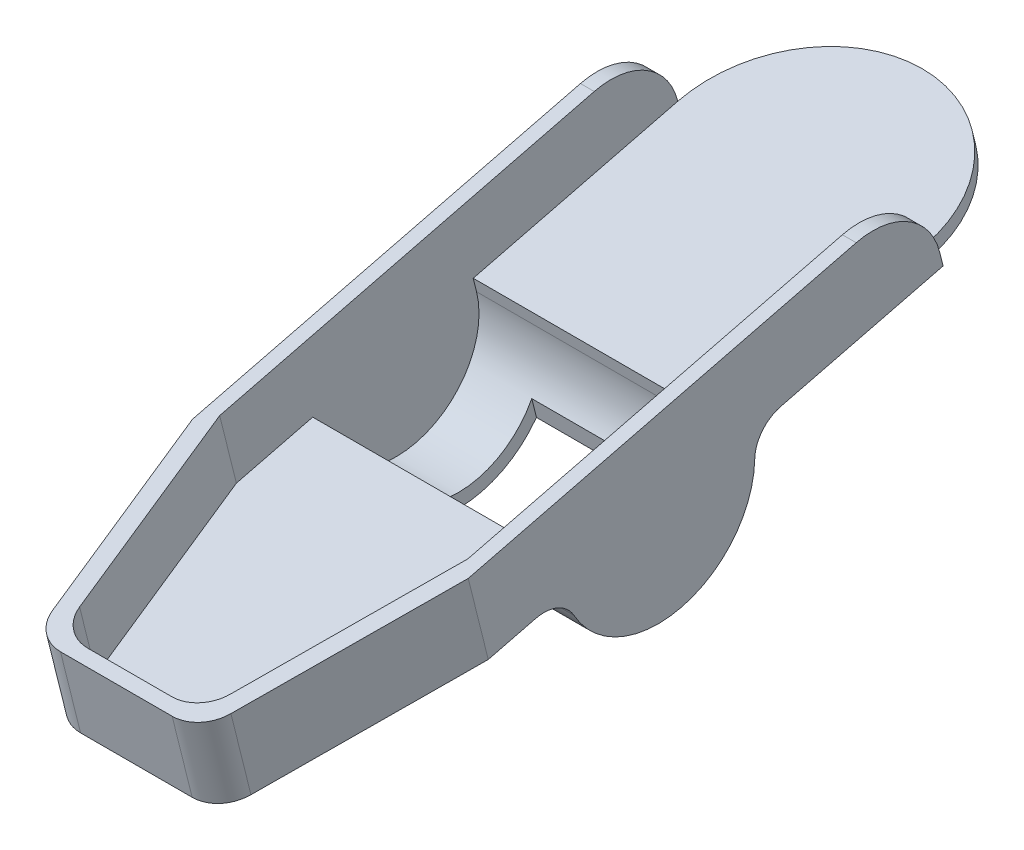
ISO-10303-21;
HEADER;
FILE_DESCRIPTION(('STEP AP214'),'2;1');
FILE_NAME('part.step','',(''),(''),'','','');
FILE_SCHEMA(('AUTOMOTIVE_DESIGN { 1 0 10303 214 1 1 1 1 }'));
ENDSEC;
DATA;
#1=APPLICATION_CONTEXT('core data for automotive mechanical design processes');
#2=APPLICATION_PROTOCOL_DEFINITION('international standard','automotive_design',2000,#1);
#3=PRODUCT_CONTEXT('',#1,'mechanical');
#4=PRODUCT('Part','Part','',(#3));
#5=PRODUCT_RELATED_PRODUCT_CATEGORY('part','',(#4));
#6=PRODUCT_DEFINITION_FORMATION('','',#4);
#7=PRODUCT_DEFINITION_CONTEXT('part definition',#1,'design');
#8=PRODUCT_DEFINITION('design','',#6,#7);
#9=PRODUCT_DEFINITION_SHAPE('','',#8);
#10=(LENGTH_UNIT() NAMED_UNIT(*) SI_UNIT(.MILLI.,.METRE.));
#11=(NAMED_UNIT(*) PLANE_ANGLE_UNIT() SI_UNIT($,.RADIAN.));
#12=(NAMED_UNIT(*) SI_UNIT($,.STERADIAN.) SOLID_ANGLE_UNIT());
#13=UNCERTAINTY_MEASURE_WITH_UNIT(LENGTH_MEASURE(1.E-05),#10,'distance_accuracy_value','');
#14=(GEOMETRIC_REPRESENTATION_CONTEXT(3) GLOBAL_UNCERTAINTY_ASSIGNED_CONTEXT((#13)) GLOBAL_UNIT_ASSIGNED_CONTEXT((#10,
#11,#12)) REPRESENTATION_CONTEXT('',''));
#15=CARTESIAN_POINT('',(0.,0.,0.));
#16=DIRECTION('',(0.,0.,1.));
#17=DIRECTION('',(1.,0.,0.));
#18=AXIS2_PLACEMENT_3D('',#15,#16,#17);
#19=CARTESIAN_POINT('',(-796.522223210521,-233.865141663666,-462.802278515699));
#20=DIRECTION('',(1.,0.,0.));
#21=DIRECTION('',(0.,0.,-1.));
#22=AXIS2_PLACEMENT_3D('',#19,#20,#21);
#23=CYLINDRICAL_SURFACE('',#22,3.17499999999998);
#24=CARTESIAN_POINT('',(-796.522223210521,-233.865141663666,-462.802278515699));
#25=DIRECTION('',(1.,0.,0.));
#26=DIRECTION('',(0.,0.,-1.));
#27=AXIS2_PLACEMENT_3D('',#24,#25,#26);
#28=CIRCLE('',#27,3.17499999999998);
#29=CARTESIAN_POINT('',(-796.522223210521,-232.313405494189,-465.572249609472));
#30=VERTEX_POINT('',#29);
#31=CARTESIAN_POINT('',(-796.522223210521,-230.784452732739,-462.03417649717));
#32=VERTEX_POINT('',#31);
#33=EDGE_CURVE('E310',#30,#32,#28,.T.);
#34=ORIENTED_EDGE('',*,*,#33,.F.);
#35=DIRECTION('',(1.,0.,0.));
#36=VECTOR('',#35,1.);
#37=CARTESIAN_POINT('',(-796.522223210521,-232.313405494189,-465.572249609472));
#38=LINE('',#37,#36);
#39=CARTESIAN_POINT('',(-771.122223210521,-232.313405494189,-465.572249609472));
#40=VERTEX_POINT('',#39);
#41=EDGE_CURVE('E382',#40,#30,#38,.F.);
#42=ORIENTED_EDGE('',*,*,#41,.F.);
#43=CARTESIAN_POINT('',(-771.122223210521,-233.865141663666,-462.802278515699));
#44=DIRECTION('',(1.,0.,0.));
#45=DIRECTION('',(0.,0.,-1.));
#46=AXIS2_PLACEMENT_3D('',#43,#44,#45);
#47=CIRCLE('',#46,3.17499999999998);
#48=CARTESIAN_POINT('',(-771.122223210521,-230.784452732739,-462.03417649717));
#49=VERTEX_POINT('',#48);
#50=EDGE_CURVE('E306',#49,#40,#47,.F.);
#51=ORIENTED_EDGE('',*,*,#50,.F.);
#52=DIRECTION('',(1.,0.,0.));
#53=VECTOR('',#52,1.);
#54=CARTESIAN_POINT('',(-783.822223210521,-230.784452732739,-462.03417649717));
#55=LINE('',#54,#53);
#56=EDGE_CURVE('E381',#32,#49,#55,.T.);
#57=ORIENTED_EDGE('',*,*,#56,.F.);
#58=EDGE_LOOP('',(#34,#42,#51,#57));
#59=FACE_BOUND('',#58,.T.);
#60=ADVANCED_FACE('F17',(#59),#23,.F.);
#61=CARTESIAN_POINT('',(-796.522223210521,-227.968544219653,-473.328168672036));
#62=DIRECTION('',(1.,0.,0.));
#63=DIRECTION('',(0.,0.,-1.));
#64=AXIS2_PLACEMENT_3D('',#61,#62,#63);
#65=CYLINDRICAL_SURFACE('',#64,8.89000000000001);
#66=DIRECTION('',(1.,0.,0.));
#67=VECTOR('',#66,1.);
#68=CARTESIAN_POINT('',(-783.822223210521,-233.193302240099,-480.520804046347));
#69=LINE('',#68,#67);
#70=CARTESIAN_POINT('',(-789.537223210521,-233.193302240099,-480.520804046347));
#71=VERTEX_POINT('',#70);
#72=CARTESIAN_POINT('',(-778.107223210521,-233.193302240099,-480.520804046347));
#73=VERTEX_POINT('',#72);
#74=EDGE_CURVE('E219',#71,#73,#69,.T.);
#75=ORIENTED_EDGE('',*,*,#74,.F.);
#76=CARTESIAN_POINT('',(-789.537223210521,-227.968544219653,-473.328168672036));
#77=DIRECTION('',(1.,0.,0.));
#78=DIRECTION('',(0.,0.,-1.));
#79=AXIS2_PLACEMENT_3D('',#76,#77,#78);
#80=CIRCLE('',#79,8.89000000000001);
#81=CARTESIAN_POINT('',(-789.537223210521,-235.958469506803,-469.430323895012));
#82=VERTEX_POINT('',#81);
#83=EDGE_CURVE('E20',#82,#71,#80,.T.);
#84=ORIENTED_EDGE('',*,*,#83,.F.);
#85=DIRECTION('',(1.,0.,0.));
#86=VECTOR('',#85,1.);
#87=CARTESIAN_POINT('',(-783.822223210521,-235.958469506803,-469.430323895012));
#88=LINE('',#87,#86);
#89=CARTESIAN_POINT('',(-778.107223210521,-235.958469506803,-469.430323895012));
#90=VERTEX_POINT('',#89);
#91=EDGE_CURVE('E216',#90,#82,#88,.F.);
#92=ORIENTED_EDGE('',*,*,#91,.F.);
#93=CARTESIAN_POINT('',(-778.107223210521,-227.968544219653,-473.328168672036));
#94=DIRECTION('',(1.,0.,0.));
#95=DIRECTION('',(0.,0.,-1.));
#96=AXIS2_PLACEMENT_3D('',#93,#94,#95);
#97=CIRCLE('',#96,8.89000000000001);
#98=EDGE_CURVE('E230',#73,#90,#97,.F.);
#99=ORIENTED_EDGE('',*,*,#98,.F.);
#100=EDGE_LOOP('',(#75,#84,#92,#99));
#101=FACE_BOUND('',#100,.T.);
#102=CARTESIAN_POINT('',(-796.522223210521,-227.968544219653,-473.328168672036));
#103=DIRECTION('',(1.,0.,0.));
#104=DIRECTION('',(0.,0.,-1.));
#105=AXIS2_PLACEMENT_3D('',#102,#103,#104);
#106=CIRCLE('',#105,8.89000000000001);
#107=CARTESIAN_POINT('',(-796.522223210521,-228.163645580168,-482.216027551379));
#108=VERTEX_POINT('',#107);
#109=EDGE_CURVE('E314',#108,#30,#106,.F.);
#110=ORIENTED_EDGE('',*,*,#109,.F.);
#111=DIRECTION('',(-1.,0.,0.));
#112=VECTOR('',#111,1.);
#113=CARTESIAN_POINT('',(-771.122223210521,-228.163645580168,-482.216027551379));
#114=LINE('',#113,#112);
#115=CARTESIAN_POINT('',(-771.122223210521,-228.163645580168,-482.216027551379));
#116=VERTEX_POINT('',#115);
#117=EDGE_CURVE('E347',#108,#116,#114,.F.);
#118=ORIENTED_EDGE('',*,*,#117,.T.);
#119=CARTESIAN_POINT('',(-771.122223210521,-227.968544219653,-473.328168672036));
#120=DIRECTION('',(1.,0.,0.));
#121=DIRECTION('',(0.,0.,-1.));
#122=AXIS2_PLACEMENT_3D('',#119,#120,#121);
#123=CIRCLE('',#122,8.89000000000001);
#124=EDGE_CURVE('E303',#40,#116,#123,.T.);
#125=ORIENTED_EDGE('',*,*,#124,.F.);
#126=ORIENTED_EDGE('',*,*,#41,.T.);
#127=EDGE_LOOP('',(#110,#118,#125,#126));
#128=FACE_BOUND('',#127,.T.);
#129=ADVANCED_FACE('F213',(#101,#128),#65,.T.);
#130=CARTESIAN_POINT('',(-783.822223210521,-221.426548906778,-499.566678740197));
#131=DIRECTION('',(0.,-0.970295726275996,-0.241921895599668));
#132=DIRECTION('',(0.,0.241921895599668,-0.970295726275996));
#133=AXIS2_PLACEMENT_3D('',#130,#131,#132);
#134=PLANE('',#133);
#135=ORIENTED_EDGE('',*,*,#56,.T.);
#136=DIRECTION('',(0.,0.241921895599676,-0.970295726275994));
#137=VECTOR('',#136,1.);
#138=CARTESIAN_POINT('',(-771.122223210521,-231.872736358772,-457.6693092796));
#139=LINE('',#138,#137);
#140=CARTESIAN_POINT('',(-771.122223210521,-231.872736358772,-457.6693092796));
#141=VERTEX_POINT('',#140);
#142=EDGE_CURVE('E309',#141,#49,#139,.T.);
#143=ORIENTED_EDGE('',*,*,#142,.F.);
#144=DIRECTION('',(0.242535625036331,0.234698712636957,-0.941325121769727));
#145=VECTOR('',#144,1.);
#146=CARTESIAN_POINT('',(-775.600985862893,-236.206779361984,-440.286412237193));
#147=LINE('',#146,#145);
#148=CARTESIAN_POINT('',(-775.600985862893,-236.206779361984,-440.286412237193));
#149=VERTEX_POINT('',#148);
#150=EDGE_CURVE('E374',#149,#141,#147,.T.);
#151=ORIENTED_EDGE('',*,*,#150,.F.);
#152=CARTESIAN_POINT('',(-778.681188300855,-236.020487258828,-441.033589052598));
#153=DIRECTION('',(0.,0.970295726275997,0.241921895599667));
#154=DIRECTION('',(0.,-0.241921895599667,0.970295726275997));
#155=AXIS2_PLACEMENT_3D('',#152,#153,#154);
#156=CIRCLE('',#155,3.17499999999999);
#157=CARTESIAN_POINT('',(-778.681188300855,-236.788589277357,-437.952900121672));
#158=VERTEX_POINT('',#157);
#159=EDGE_CURVE('E326',#158,#149,#156,.T.);
#160=ORIENTED_EDGE('',*,*,#159,.F.);
#161=DIRECTION('',(1.,0.,0.));
#162=VECTOR('',#161,1.);
#163=CARTESIAN_POINT('',(-776.202223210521,-236.788589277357,-437.952900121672));
#164=LINE('',#163,#162);
#165=CARTESIAN_POINT('',(-788.963258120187,-236.788589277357,-437.952900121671));
#166=VERTEX_POINT('',#165);
#167=EDGE_CURVE('E327',#166,#158,#164,.T.);
#168=ORIENTED_EDGE('',*,*,#167,.F.);
#169=CARTESIAN_POINT('',(-788.963258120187,-236.020487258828,-441.033589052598));
#170=DIRECTION('',(0.,0.970295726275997,0.241921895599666));
#171=DIRECTION('',(0.,-0.241921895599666,0.970295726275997));
#172=AXIS2_PLACEMENT_3D('',#169,#170,#171);
#173=CIRCLE('',#172,3.17500000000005);
#174=CARTESIAN_POINT('',(-792.043460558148,-236.206779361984,-440.286412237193));
#175=VERTEX_POINT('',#174);
#176=EDGE_CURVE('E321',#175,#166,#173,.T.);
#177=ORIENTED_EDGE('',*,*,#176,.F.);
#178=DIRECTION('',(0.242535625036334,-0.234698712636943,0.94132512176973));
#179=VECTOR('',#178,1.);
#180=CARTESIAN_POINT('',(-796.522223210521,-231.872736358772,-457.6693092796));
#181=LINE('',#180,#179);
#182=CARTESIAN_POINT('',(-796.522223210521,-231.872736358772,-457.6693092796));
#183=VERTEX_POINT('',#182);
#184=EDGE_CURVE('E385',#183,#175,#181,.T.);
#185=ORIENTED_EDGE('',*,*,#184,.F.);
#186=DIRECTION('',(0.,-0.241921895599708,0.970295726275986));
#187=VECTOR('',#186,1.);
#188=CARTESIAN_POINT('',(-796.522223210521,-230.784452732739,-462.03417649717));
#189=LINE('',#188,#187);
#190=EDGE_CURVE('E313',#32,#183,#189,.T.);
#191=ORIENTED_EDGE('',*,*,#190,.F.);
#192=EDGE_LOOP('',(#135,#143,#151,#160,#168,#177,#185,#191));
#193=FACE_BOUND('',#192,.T.);
#194=ADVANCED_FACE('F864',(#193),#134,.T.);
#195=CARTESIAN_POINT('',(-771.122223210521,-228.233324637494,-485.390262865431));
#196=DIRECTION('',(-1.,0.,0.));
#197=DIRECTION('',(0.,0.,1.));
#198=AXIS2_PLACEMENT_3D('',#195,#196,#197);
#199=CYLINDRICAL_SURFACE('',#198,3.17499999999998);
#200=CARTESIAN_POINT('',(-771.122223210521,-228.233324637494,-485.390262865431));
#201=DIRECTION('',(-1.,0.,0.));
#202=DIRECTION('',(0.,0.,1.));
#203=AXIS2_PLACEMENT_3D('',#200,#201,#202);
#204=CIRCLE('',#203,3.17499999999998);
#205=CARTESIAN_POINT('',(-771.122223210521,-225.152635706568,-484.622160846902));
#206=VERTEX_POINT('',#205);
#207=EDGE_CURVE('E300',#116,#206,#204,.T.);
#208=ORIENTED_EDGE('',*,*,#207,.F.);
#209=ORIENTED_EDGE('',*,*,#117,.F.);
#210=CARTESIAN_POINT('',(-796.522223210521,-228.233324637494,-485.390262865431));
#211=DIRECTION('',(-1.,0.,0.));
#212=DIRECTION('',(0.,0.,1.));
#213=AXIS2_PLACEMENT_3D('',#210,#211,#212);
#214=CIRCLE('',#213,3.17499999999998);
#215=CARTESIAN_POINT('',(-796.522223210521,-225.152635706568,-484.622160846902));
#216=VERTEX_POINT('',#215);
#217=EDGE_CURVE('E317',#216,#108,#214,.F.);
#218=ORIENTED_EDGE('',*,*,#217,.F.);
#219=DIRECTION('',(1.,0.,0.));
#220=VECTOR('',#219,1.);
#221=CARTESIAN_POINT('',(-783.822223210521,-225.152635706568,-484.622160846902));
#222=LINE('',#221,#220);
#223=EDGE_CURVE('E363',#206,#216,#222,.F.);
#224=ORIENTED_EDGE('',*,*,#223,.F.);
#225=EDGE_LOOP('',(#208,#209,#218,#224));
#226=FACE_BOUND('',#225,.T.);
#227=ADVANCED_FACE('F854',(#226),#199,.F.);
#228=CARTESIAN_POINT('',(-783.822223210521,-229.811989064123,-465.934515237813));
#229=DIRECTION('',(0.,0.241921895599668,-0.970295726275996));
#230=DIRECTION('',(0.,0.970295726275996,0.241921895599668));
#231=AXIS2_PLACEMENT_3D('',#228,#229,#230);
#232=PLANE('',#231);
#233=DIRECTION('',(1.,0.,0.));
#234=VECTOR('',#233,1.);
#235=CARTESIAN_POINT('',(-795.252223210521,-229.811989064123,-465.934515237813));
#236=LINE('',#235,#234);
#237=CARTESIAN_POINT('',(-772.392223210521,-229.811989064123,-465.934515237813));
#238=VERTEX_POINT('',#237);
#239=CARTESIAN_POINT('',(-795.252223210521,-229.811989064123,-465.934515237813));
#240=VERTEX_POINT('',#239);
#241=EDGE_CURVE('E286',#238,#240,#236,.F.);
#242=ORIENTED_EDGE('',*,*,#241,.T.);
#243=DIRECTION('',(0.,0.970295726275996,0.241921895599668));
#244=VECTOR('',#243,1.);
#245=CARTESIAN_POINT('',(-795.252223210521,-229.811989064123,-465.934515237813));
#246=LINE('',#245,#244);
#247=CARTESIAN_POINT('',(-795.252223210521,-228.579713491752,-465.627274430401));
#248=VERTEX_POINT('',#247);
#249=EDGE_CURVE('E222',#240,#248,#246,.T.);
#250=ORIENTED_EDGE('',*,*,#249,.T.);
#251=DIRECTION('',(1.,0.,0.));
#252=VECTOR('',#251,1.);
#253=CARTESIAN_POINT('',(-783.822223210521,-228.579713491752,-465.627274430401));
#254=LINE('',#253,#252);
#255=CARTESIAN_POINT('',(-772.392223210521,-228.579713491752,-465.627274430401));
#256=VERTEX_POINT('',#255);
#257=EDGE_CURVE('E290',#256,#248,#254,.F.);
#258=ORIENTED_EDGE('',*,*,#257,.F.);
#259=DIRECTION('',(0.,0.970295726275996,0.241921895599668));
#260=VECTOR('',#259,1.);
#261=CARTESIAN_POINT('',(-772.392223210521,-229.811989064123,-465.934515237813));
#262=LINE('',#261,#260);
#263=EDGE_CURVE('E344',#256,#238,#262,.F.);
#264=ORIENTED_EDGE('',*,*,#263,.T.);
#265=EDGE_LOOP('',(#242,#250,#258,#264));
#266=FACE_BOUND('',#265,.T.);
#267=ADVANCED_FACE('F845',(#266),#232,.T.);
#268=CARTESIAN_POINT('',(-789.537223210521,-234.129922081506,-474.864372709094));
#269=DIRECTION('',(1.,0.,0.));
#270=DIRECTION('',(0.,1.,0.));
#271=AXIS2_PLACEMENT_3D('',#268,#269,#270);
#272=PLANE('',#271);
#273=DIRECTION('',(0.,-0.970295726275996,-0.241921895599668));
#274=VECTOR('',#273,1.);
#275=CARTESIAN_POINT('',(-789.537223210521,-232.747338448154,-480.409612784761));
#276=LINE('',#275,#274);
#277=CARTESIAN_POINT('',(-789.537223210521,-231.47640265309,-480.092732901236));
#278=VERTEX_POINT('',#277);
#279=EDGE_CURVE('E331',#278,#71,#276,.T.);
#280=ORIENTED_EDGE('',*,*,#279,.F.);
#281=CARTESIAN_POINT('',(-789.537223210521,-227.968544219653,-473.328168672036));
#282=DIRECTION('',(1.,0.,0.));
#283=DIRECTION('',(0.,0.,-1.));
#284=AXIS2_PLACEMENT_3D('',#281,#282,#283);
#285=CIRCLE('',#284,7.62000000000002);
#286=CARTESIAN_POINT('',(-789.537223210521,-234.241569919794,-469.002252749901));
#287=VERTEX_POINT('',#286);
#288=EDGE_CURVE('E227',#278,#287,#285,.F.);
#289=ORIENTED_EDGE('',*,*,#288,.T.);
#290=DIRECTION('',(0.,0.970295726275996,0.241921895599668));
#291=VECTOR('',#290,1.);
#292=CARTESIAN_POINT('',(-789.537223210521,-235.512505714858,-469.319132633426));
#293=LINE('',#292,#291);
#294=EDGE_CURVE('E224',#82,#287,#293,.T.);
#295=ORIENTED_EDGE('',*,*,#294,.F.);
#296=ORIENTED_EDGE('',*,*,#83,.T.);
#297=EDGE_LOOP('',(#280,#289,#295,#296));
#298=FACE_BOUND('',#297,.T.);
#299=ADVANCED_FACE('F225',(#298),#272,.T.);
#300=CARTESIAN_POINT('',(-783.822223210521,-235.512505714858,-469.319132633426));
#301=DIRECTION('',(0.,0.241921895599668,-0.970295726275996));
#302=DIRECTION('',(0.,0.970295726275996,0.241921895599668));
#303=AXIS2_PLACEMENT_3D('',#300,#301,#302);
#304=PLANE('',#303);
#305=ORIENTED_EDGE('',*,*,#91,.T.);
#306=ORIENTED_EDGE('',*,*,#294,.T.);
#307=DIRECTION('',(1.,0.,0.));
#308=VECTOR('',#307,1.);
#309=CARTESIAN_POINT('',(-795.252223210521,-234.241569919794,-469.002252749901));
#310=LINE('',#309,#308);
#311=CARTESIAN_POINT('',(-778.107223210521,-234.241569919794,-469.002252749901));
#312=VERTEX_POINT('',#311);
#313=EDGE_CURVE('E284',#287,#312,#310,.T.);
#314=ORIENTED_EDGE('',*,*,#313,.T.);
#315=DIRECTION('',(0.,0.970295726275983,0.241921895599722));
#316=VECTOR('',#315,1.);
#317=CARTESIAN_POINT('',(-778.107223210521,-235.958469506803,-469.430323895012));
#318=LINE('',#317,#316);
#319=EDGE_CURVE('E234',#90,#312,#318,.T.);
#320=ORIENTED_EDGE('',*,*,#319,.F.);
#321=EDGE_LOOP('',(#305,#306,#314,#320));
#322=FACE_BOUND('',#321,.T.);
#323=ADVANCED_FACE('F232',(#322),#304,.T.);
#324=CARTESIAN_POINT('',(-778.107223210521,-234.129922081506,-474.864372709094));
#325=DIRECTION('',(-1.,0.,0.));
#326=DIRECTION('',(0.,-1.,0.));
#327=AXIS2_PLACEMENT_3D('',#324,#325,#326);
#328=PLANE('',#327);
#329=ORIENTED_EDGE('',*,*,#319,.T.);
#330=CARTESIAN_POINT('',(-778.107223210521,-227.968544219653,-473.328168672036));
#331=DIRECTION('',(1.,0.,0.));
#332=DIRECTION('',(0.,0.,-1.));
#333=AXIS2_PLACEMENT_3D('',#330,#331,#332);
#334=CIRCLE('',#333,7.62000000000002);
#335=CARTESIAN_POINT('',(-778.107223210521,-231.47640265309,-480.092732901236));
#336=VERTEX_POINT('',#335);
#337=EDGE_CURVE('E282',#312,#336,#334,.T.);
#338=ORIENTED_EDGE('',*,*,#337,.T.);
#339=DIRECTION('',(0.,-0.970295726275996,-0.241921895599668));
#340=VECTOR('',#339,1.);
#341=CARTESIAN_POINT('',(-778.107223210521,-232.747338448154,-480.409612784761));
#342=LINE('',#341,#340);
#343=EDGE_CURVE('E328',#73,#336,#342,.F.);
#344=ORIENTED_EDGE('',*,*,#343,.F.);
#345=ORIENTED_EDGE('',*,*,#98,.T.);
#346=EDGE_LOOP('',(#329,#338,#344,#345));
#347=FACE_BOUND('',#346,.T.);
#348=ADVANCED_FACE('F819',(#347),#328,.T.);
#349=CARTESIAN_POINT('',(-783.822223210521,-232.747338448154,-480.409612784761));
#350=DIRECTION('',(0.,-0.241921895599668,0.970295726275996));
#351=DIRECTION('',(0.,-0.970295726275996,-0.241921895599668));
#352=AXIS2_PLACEMENT_3D('',#349,#350,#351);
#353=PLANE('',#352);
#354=ORIENTED_EDGE('',*,*,#74,.T.);
#355=ORIENTED_EDGE('',*,*,#343,.T.);
#356=DIRECTION('',(1.,0.,0.));
#357=VECTOR('',#356,1.);
#358=CARTESIAN_POINT('',(-795.252223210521,-231.47640265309,-480.092732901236));
#359=LINE('',#358,#357);
#360=EDGE_CURVE('E281',#336,#278,#359,.F.);
#361=ORIENTED_EDGE('',*,*,#360,.T.);
#362=ORIENTED_EDGE('',*,*,#279,.T.);
#363=EDGE_LOOP('',(#354,#355,#361,#362));
#364=FACE_BOUND('',#363,.T.);
#365=ADVANCED_FACE('F809',(#364),#353,.T.);
#366=CARTESIAN_POINT('',(-778.681188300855,-236.020487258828,-441.033589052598));
#367=DIRECTION('',(0.,0.970295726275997,0.241921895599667));
#368=DIRECTION('',(0.,-0.241921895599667,0.970295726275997));
#369=AXIS2_PLACEMENT_3D('',#366,#367,#368);
#370=CYLINDRICAL_SURFACE('',#369,3.17499999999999);
#371=DIRECTION('',(0.,-0.970295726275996,-0.241921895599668));
#372=VECTOR('',#371,1.);
#373=CARTESIAN_POINT('',(-778.681188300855,-236.788589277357,-437.952900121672));
#374=LINE('',#373,#372);
#375=CARTESIAN_POINT('',(-778.681188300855,-229.394935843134,-436.109455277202));
#376=VERTEX_POINT('',#375);
#377=EDGE_CURVE('E325',#158,#376,#374,.F.);
#378=ORIENTED_EDGE('',*,*,#377,.F.);
#379=ORIENTED_EDGE('',*,*,#159,.T.);
#380=DIRECTION('',(0.,-0.970295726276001,-0.241921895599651));
#381=VECTOR('',#380,1.);
#382=CARTESIAN_POINT('',(-775.600985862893,-228.813125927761,-438.442967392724));
#383=LINE('',#382,#381);
#384=CARTESIAN_POINT('',(-775.600985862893,-228.813125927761,-438.442967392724));
#385=VERTEX_POINT('',#384);
#386=EDGE_CURVE('E377',#385,#149,#383,.T.);
#387=ORIENTED_EDGE('',*,*,#386,.F.);
#388=CARTESIAN_POINT('',(-778.681188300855,-228.626833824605,-439.190144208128));
#389=DIRECTION('',(0.,0.970295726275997,0.241921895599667));
#390=DIRECTION('',(0.,-0.241921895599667,0.970295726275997));
#391=AXIS2_PLACEMENT_3D('',#388,#389,#390);
#392=CIRCLE('',#391,3.17499999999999);
#393=EDGE_CURVE('E275',#385,#376,#392,.F.);
#394=ORIENTED_EDGE('',*,*,#393,.T.);
#395=EDGE_LOOP('',(#378,#379,#387,#394));
#396=FACE_BOUND('',#395,.T.);
#397=ADVANCED_FACE('F800',(#396),#370,.T.);
#398=CARTESIAN_POINT('',(-776.202223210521,-236.788589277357,-437.952900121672));
#399=DIRECTION('',(0.,-0.241921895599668,0.970295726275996));
#400=DIRECTION('',(0.,-0.970295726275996,-0.241921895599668));
#401=AXIS2_PLACEMENT_3D('',#398,#399,#400);
#402=PLANE('',#401);
#403=ORIENTED_EDGE('',*,*,#377,.T.);
#404=DIRECTION('',(1.,0.,0.));
#405=VECTOR('',#404,1.);
#406=CARTESIAN_POINT('',(-791.442223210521,-229.394935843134,-436.109455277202));
#407=LINE('',#406,#405);
#408=CARTESIAN_POINT('',(-788.963258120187,-229.394935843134,-436.109455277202));
#409=VERTEX_POINT('',#408);
#410=EDGE_CURVE('E274',#376,#409,#407,.F.);
#411=ORIENTED_EDGE('',*,*,#410,.T.);
#412=DIRECTION('',(0.,0.970295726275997,0.241921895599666));
#413=VECTOR('',#412,1.);
#414=CARTESIAN_POINT('',(-788.963258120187,-236.788589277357,-437.952900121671));
#415=LINE('',#414,#413);
#416=EDGE_CURVE('E324',#166,#409,#415,.T.);
#417=ORIENTED_EDGE('',*,*,#416,.F.);
#418=ORIENTED_EDGE('',*,*,#167,.T.);
#419=EDGE_LOOP('',(#403,#411,#417,#418));
#420=FACE_BOUND('',#419,.T.);
#421=ADVANCED_FACE('F791',(#420),#402,.T.);
#422=CARTESIAN_POINT('',(-788.963258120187,-236.020487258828,-441.033589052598));
#423=DIRECTION('',(0.,0.970295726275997,0.241921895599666));
#424=DIRECTION('',(0.,-0.241921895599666,0.970295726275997));
#425=AXIS2_PLACEMENT_3D('',#422,#423,#424);
#426=CYLINDRICAL_SURFACE('',#425,3.17500000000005);
#427=ORIENTED_EDGE('',*,*,#416,.T.);
#428=CARTESIAN_POINT('',(-788.963258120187,-228.626833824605,-439.190144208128));
#429=DIRECTION('',(0.,0.970295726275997,0.241921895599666));
#430=DIRECTION('',(0.,-0.241921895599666,0.970295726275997));
#431=AXIS2_PLACEMENT_3D('',#428,#429,#430);
#432=CIRCLE('',#431,3.17500000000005);
#433=CARTESIAN_POINT('',(-792.043460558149,-228.813125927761,-438.442967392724));
#434=VERTEX_POINT('',#433);
#435=EDGE_CURVE('E271',#409,#434,#432,.F.);
#436=ORIENTED_EDGE('',*,*,#435,.T.);
#437=DIRECTION('',(0.,0.970295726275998,0.241921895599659));
#438=VECTOR('',#437,1.);
#439=CARTESIAN_POINT('',(-792.043460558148,-236.206779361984,-440.286412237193));
#440=LINE('',#439,#438);
#441=EDGE_CURVE('E320',#175,#434,#440,.T.);
#442=ORIENTED_EDGE('',*,*,#441,.F.);
#443=ORIENTED_EDGE('',*,*,#176,.T.);
#444=EDGE_LOOP('',(#427,#436,#442,#443));
#445=FACE_BOUND('',#444,.T.);
#446=ADVANCED_FACE('F782',(#445),#426,.T.);
#447=CARTESIAN_POINT('',(-791.442223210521,-236.788589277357,-437.952900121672));
#448=DIRECTION('',(-0.970142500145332,-0.0586746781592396,0.235331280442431));
#449=DIRECTION('',(0.235737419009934,0.,0.971816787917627));
#450=AXIS2_PLACEMENT_3D('',#447,#448,#449);
#451=PLANE('',#450);
#452=ORIENTED_EDGE('',*,*,#441,.T.);
#453=DIRECTION('',(-0.242535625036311,0.234698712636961,-0.941325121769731));
#454=VECTOR('',#453,1.);
#455=CARTESIAN_POINT('',(-792.043460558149,-228.813125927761,-438.442967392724));
#456=LINE('',#455,#454);
#457=CARTESIAN_POINT('',(-796.522223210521,-224.479082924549,-455.82586443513));
#458=VERTEX_POINT('',#457);
#459=EDGE_CURVE('E273',#434,#458,#456,.T.);
#460=ORIENTED_EDGE('',*,*,#459,.T.);
#461=DIRECTION('',(0.,0.970295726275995,0.241921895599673));
#462=VECTOR('',#461,1.);
#463=CARTESIAN_POINT('',(-796.522223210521,-231.872736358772,-457.6693092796));
#464=LINE('',#463,#462);
#465=EDGE_CURVE('E441',#183,#458,#464,.T.);
#466=ORIENTED_EDGE('',*,*,#465,.F.);
#467=ORIENTED_EDGE('',*,*,#184,.T.);
#468=EDGE_LOOP('',(#452,#460,#466,#467));
#469=FACE_BOUND('',#468,.T.);
#470=ADVANCED_FACE('F460',(#469),#451,.T.);
#471=CARTESIAN_POINT('',(-796.522223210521,-231.872736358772,-457.6693092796));
#472=DIRECTION('',(-1.,0.,0.));
#473=DIRECTION('',(0.,0.,1.));
#474=AXIS2_PLACEMENT_3D('',#471,#472,#473);
#475=PLANE('',#474);
#476=ORIENTED_EDGE('',*,*,#190,.T.);
#477=ORIENTED_EDGE('',*,*,#465,.T.);
#478=DIRECTION('',(0.,0.241921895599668,-0.970295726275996));
#479=VECTOR('',#478,1.);
#480=CARTESIAN_POINT('',(-796.522223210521,-229.394935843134,-436.109455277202));
#481=LINE('',#480,#479);
#482=CARTESIAN_POINT('',(-796.522223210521,-215.569099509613,-491.561856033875));
#483=VERTEX_POINT('',#482);
#484=EDGE_CURVE('E444',#458,#483,#481,.T.);
#485=ORIENTED_EDGE('',*,*,#484,.T.);
#486=CARTESIAN_POINT('',(-796.522223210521,-221.730477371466,-493.098060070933));
#487=DIRECTION('',(1.,0.,0.));
#488=DIRECTION('',(0.,0.,-1.));
#489=AXIS2_PLACEMENT_3D('',#486,#487,#488);
#490=CIRCLE('',#489,6.34999999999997);
#491=CARTESIAN_POINT('',(-796.522223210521,-220.194273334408,-499.259437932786));
#492=VERTEX_POINT('',#491);
#493=EDGE_CURVE('E296',#492,#483,#490,.T.);
#494=ORIENTED_EDGE('',*,*,#493,.F.);
#495=DIRECTION('',(0.,0.970295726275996,0.241921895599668));
#496=VECTOR('',#495,1.);
#497=CARTESIAN_POINT('',(-796.522223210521,-221.426548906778,-499.566678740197));
#498=LINE('',#497,#496);
#499=CARTESIAN_POINT('',(-796.522223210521,-221.426548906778,-499.566678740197));
#500=VERTEX_POINT('',#499);
#501=EDGE_CURVE('E353',#500,#492,#498,.T.);
#502=ORIENTED_EDGE('',*,*,#501,.F.);
#503=DIRECTION('',(0.,0.241921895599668,-0.970295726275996));
#504=VECTOR('',#503,1.);
#505=CARTESIAN_POINT('',(-796.522223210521,-221.426548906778,-499.566678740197));
#506=LINE('',#505,#504);
#507=EDGE_CURVE('E359',#216,#500,#506,.T.);
#508=ORIENTED_EDGE('',*,*,#507,.F.);
#509=ORIENTED_EDGE('',*,*,#217,.T.);
#510=ORIENTED_EDGE('',*,*,#109,.T.);
#511=ORIENTED_EDGE('',*,*,#33,.T.);
#512=EDGE_LOOP('',(#476,#477,#485,#494,#502,#508,#509,#510,#511));
#513=FACE_BOUND('',#512,.T.);
#514=ADVANCED_FACE('F764',(#513),#475,.T.);
#515=CARTESIAN_POINT('',(-787.693258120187,-234.480970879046,-441.958623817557));
#516=DIRECTION('',(0.,0.970295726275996,0.241921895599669));
#517=DIRECTION('',(0.,-0.241921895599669,0.970295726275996));
#518=AXIS2_PLACEMENT_3D('',#515,#516,#517);
#519=CYLINDRICAL_SURFACE('',#518,3.17499999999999);
#520=CARTESIAN_POINT('',(-787.693258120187,-234.480970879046,-441.958623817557));
#521=DIRECTION('',(0.,0.970295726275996,0.241921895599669));
#522=DIRECTION('',(0.,-0.241921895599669,0.970295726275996));
#523=AXIS2_PLACEMENT_3D('',#520,#521,#522);
#524=CIRCLE('',#523,3.17499999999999);
#525=CARTESIAN_POINT('',(-790.773460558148,-234.667262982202,-441.211447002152));
#526=VERTEX_POINT('',#525);
#527=CARTESIAN_POINT('',(-787.693258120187,-235.249072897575,-438.87793488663));
#528=VERTEX_POINT('',#527);
#529=EDGE_CURVE('E292',#526,#528,#524,.T.);
#530=ORIENTED_EDGE('',*,*,#529,.F.);
#531=DIRECTION('',(0.,0.970295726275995,0.241921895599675));
#532=VECTOR('',#531,1.);
#533=CARTESIAN_POINT('',(-790.773460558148,-234.667262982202,-441.211447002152));
#534=LINE('',#533,#532);
#535=CARTESIAN_POINT('',(-790.773460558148,-228.505885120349,-439.675242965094));
#536=VERTEX_POINT('',#535);
#537=EDGE_CURVE('E442',#526,#536,#534,.T.);
#538=ORIENTED_EDGE('',*,*,#537,.T.);
#539=CARTESIAN_POINT('',(-787.693258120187,-228.319593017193,-440.422419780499));
#540=DIRECTION('',(0.,0.970295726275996,0.241921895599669));
#541=DIRECTION('',(0.,-0.241921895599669,0.970295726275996));
#542=AXIS2_PLACEMENT_3D('',#539,#540,#541);
#543=CIRCLE('',#542,3.17499999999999);
#544=CARTESIAN_POINT('',(-787.693258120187,-229.087695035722,-437.341730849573));
#545=VERTEX_POINT('',#544);
#546=EDGE_CURVE('E268',#536,#545,#543,.T.);
#547=ORIENTED_EDGE('',*,*,#546,.T.);
#548=DIRECTION('',(0.,-0.970295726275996,-0.241921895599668));
#549=VECTOR('',#548,1.);
#550=CARTESIAN_POINT('',(-787.693258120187,-235.249072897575,-438.87793488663));
#551=LINE('',#550,#549);
#552=EDGE_CURVE('E436',#545,#528,#551,.T.);
#553=ORIENTED_EDGE('',*,*,#552,.T.);
#554=EDGE_LOOP('',(#530,#538,#547,#553));
#555=FACE_BOUND('',#554,.T.);
#556=ADVANCED_FACE('F546',(#555),#519,.F.);
#557=CARTESIAN_POINT('',(-777.472223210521,-235.249072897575,-438.87793488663));
#558=DIRECTION('',(0.,-0.241921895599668,0.970295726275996));
#559=DIRECTION('',(0.,-0.970295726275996,-0.241921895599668));
#560=AXIS2_PLACEMENT_3D('',#557,#558,#559);
#561=PLANE('',#560);
#562=DIRECTION('',(0.,0.970295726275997,0.241921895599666));
#563=VECTOR('',#562,1.);
#564=CARTESIAN_POINT('',(-779.951188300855,-235.249072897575,-438.87793488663));
#565=LINE('',#564,#563);
#566=CARTESIAN_POINT('',(-779.951188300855,-229.087695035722,-437.341730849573));
#567=VERTEX_POINT('',#566);
#568=CARTESIAN_POINT('',(-779.951188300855,-235.249072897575,-438.87793488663));
#569=VERTEX_POINT('',#568);
#570=EDGE_CURVE('E356',#567,#569,#565,.F.);
#571=ORIENTED_EDGE('',*,*,#570,.T.);
#572=DIRECTION('',(1.,0.,0.));
#573=VECTOR('',#572,1.);
#574=CARTESIAN_POINT('',(-783.822223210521,-235.249072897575,-438.87793488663));
#575=LINE('',#574,#573);
#576=EDGE_CURVE('E291',#528,#569,#575,.T.);
#577=ORIENTED_EDGE('',*,*,#576,.F.);
#578=ORIENTED_EDGE('',*,*,#552,.F.);
#579=DIRECTION('',(1.,0.,0.));
#580=VECTOR('',#579,1.);
#581=CARTESIAN_POINT('',(-791.442223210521,-229.087695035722,-437.341730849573));
#582=LINE('',#581,#580);
#583=EDGE_CURVE('E267',#545,#567,#582,.T.);
#584=ORIENTED_EDGE('',*,*,#583,.T.);
#585=EDGE_LOOP('',(#571,#577,#578,#584));
#586=FACE_BOUND('',#585,.T.);
#587=ADVANCED_FACE('F549',(#586),#561,.F.);
#588=CARTESIAN_POINT('',(-771.122223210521,-221.426548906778,-499.566678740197));
#589=DIRECTION('',(1.,0.,0.));
#590=DIRECTION('',(0.,0.,-1.));
#591=AXIS2_PLACEMENT_3D('',#588,#589,#590);
#592=PLANE('',#591);
#593=ORIENTED_EDGE('',*,*,#207,.T.);
#594=DIRECTION('',(0.,0.241921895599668,-0.970295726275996));
#595=VECTOR('',#594,1.);
#596=CARTESIAN_POINT('',(-771.122223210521,-221.426548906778,-499.566678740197));
#597=LINE('',#596,#595);
#598=CARTESIAN_POINT('',(-771.122223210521,-221.426548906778,-499.566678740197));
#599=VERTEX_POINT('',#598);
#600=EDGE_CURVE('E368',#599,#206,#597,.F.);
#601=ORIENTED_EDGE('',*,*,#600,.F.);
#602=DIRECTION('',(0.,0.970295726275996,0.241921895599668));
#603=VECTOR('',#602,1.);
#604=CARTESIAN_POINT('',(-771.122223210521,-221.426548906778,-499.566678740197));
#605=LINE('',#604,#603);
#606=CARTESIAN_POINT('',(-771.122223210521,-220.194273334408,-499.259437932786));
#607=VERTEX_POINT('',#606);
#608=EDGE_CURVE('E355',#607,#599,#605,.F.);
#609=ORIENTED_EDGE('',*,*,#608,.F.);
#610=CARTESIAN_POINT('',(-771.122223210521,-221.730477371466,-493.098060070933));
#611=DIRECTION('',(1.,0.,0.));
#612=DIRECTION('',(0.,0.,-1.));
#613=AXIS2_PLACEMENT_3D('',#610,#611,#612);
#614=CIRCLE('',#613,6.34999999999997);
#615=CARTESIAN_POINT('',(-771.122223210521,-215.569099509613,-491.561856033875));
#616=VERTEX_POINT('',#615);
#617=EDGE_CURVE('E278',#616,#607,#614,.F.);
#618=ORIENTED_EDGE('',*,*,#617,.F.);
#619=DIRECTION('',(0.,0.241921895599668,-0.970295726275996));
#620=VECTOR('',#619,1.);
#621=CARTESIAN_POINT('',(-771.122223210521,-229.394935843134,-436.109455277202));
#622=LINE('',#621,#620);
#623=CARTESIAN_POINT('',(-771.122223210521,-224.479082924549,-455.82586443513));
#624=VERTEX_POINT('',#623);
#625=EDGE_CURVE('E430',#616,#624,#622,.F.);
#626=ORIENTED_EDGE('',*,*,#625,.T.);
#627=DIRECTION('',(0.,0.970295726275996,0.241921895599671));
#628=VECTOR('',#627,1.);
#629=CARTESIAN_POINT('',(-771.122223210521,-231.872736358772,-457.6693092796));
#630=LINE('',#629,#628);
#631=EDGE_CURVE('E302',#141,#624,#630,.T.);
#632=ORIENTED_EDGE('',*,*,#631,.F.);
#633=ORIENTED_EDGE('',*,*,#142,.T.);
#634=ORIENTED_EDGE('',*,*,#50,.T.);
#635=ORIENTED_EDGE('',*,*,#124,.T.);
#636=EDGE_LOOP('',(#593,#601,#609,#618,#626,#632,#633,#634,#635));
#637=FACE_BOUND('',#636,.T.);
#638=ADVANCED_FACE('F737',(#637),#592,.T.);
#639=CARTESIAN_POINT('',(-771.122223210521,-231.872736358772,-457.6693092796));
#640=DIRECTION('',(0.970142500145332,-0.05867467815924,0.235331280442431));
#641=DIRECTION('',(0.235737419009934,0.,-0.971816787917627));
#642=AXIS2_PLACEMENT_3D('',#639,#640,#641);
#643=PLANE('',#642);
#644=ORIENTED_EDGE('',*,*,#386,.T.);
#645=ORIENTED_EDGE('',*,*,#150,.T.);
#646=ORIENTED_EDGE('',*,*,#631,.T.);
#647=DIRECTION('',(-0.242535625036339,-0.234698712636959,0.941325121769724));
#648=VECTOR('',#647,1.);
#649=CARTESIAN_POINT('',(-771.122223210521,-224.479082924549,-455.82586443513));
#650=LINE('',#649,#648);
#651=EDGE_CURVE('E414',#624,#385,#650,.T.);
#652=ORIENTED_EDGE('',*,*,#651,.T.);
#653=EDGE_LOOP('',(#644,#645,#646,#652));
#654=FACE_BOUND('',#653,.T.);
#655=ADVANCED_FACE('F727',(#654),#643,.T.);
#656=CARTESIAN_POINT('',(-779.951188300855,-234.480970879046,-441.958623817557));
#657=DIRECTION('',(0.,0.970295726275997,0.241921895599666));
#658=DIRECTION('',(0.,-0.241921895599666,0.970295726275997));
#659=AXIS2_PLACEMENT_3D('',#656,#657,#658);
#660=CYLINDRICAL_SURFACE('',#659,3.17499999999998);
#661=CARTESIAN_POINT('',(-779.951188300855,-234.480970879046,-441.958623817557));
#662=DIRECTION('',(0.,0.970295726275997,0.241921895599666));
#663=DIRECTION('',(0.,-0.241921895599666,0.970295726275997));
#664=AXIS2_PLACEMENT_3D('',#661,#662,#663);
#665=CIRCLE('',#664,3.17499999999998);
#666=CARTESIAN_POINT('',(-776.870985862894,-234.667262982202,-441.211447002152));
#667=VERTEX_POINT('',#666);
#668=EDGE_CURVE('E287',#569,#667,#665,.T.);
#669=ORIENTED_EDGE('',*,*,#668,.F.);
#670=ORIENTED_EDGE('',*,*,#570,.F.);
#671=CARTESIAN_POINT('',(-779.951188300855,-228.319593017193,-440.422419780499));
#672=DIRECTION('',(0.,0.970295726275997,0.241921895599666));
#673=DIRECTION('',(0.,-0.241921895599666,0.970295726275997));
#674=AXIS2_PLACEMENT_3D('',#671,#672,#673);
#675=CIRCLE('',#674,3.17499999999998);
#676=CARTESIAN_POINT('',(-776.870985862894,-228.505885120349,-439.675242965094));
#677=VERTEX_POINT('',#676);
#678=EDGE_CURVE('E264',#567,#677,#675,.T.);
#679=ORIENTED_EDGE('',*,*,#678,.T.);
#680=DIRECTION('',(0.,-0.970295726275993,-0.24192189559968));
#681=VECTOR('',#680,1.);
#682=CARTESIAN_POINT('',(-776.870985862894,-228.505885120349,-439.675242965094));
#683=LINE('',#682,#681);
#684=EDGE_CURVE('E411',#677,#667,#683,.T.);
#685=ORIENTED_EDGE('',*,*,#684,.T.);
#686=EDGE_LOOP('',(#669,#670,#679,#685));
#687=FACE_BOUND('',#686,.T.);
#688=ADVANCED_FACE('F718',(#687),#660,.F.);
#689=CARTESIAN_POINT('',(-796.522223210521,-221.426548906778,-499.566678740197));
#690=DIRECTION('',(0.,0.241921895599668,-0.970295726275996));
#691=DIRECTION('',(0.,0.970295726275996,0.241921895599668));
#692=AXIS2_PLACEMENT_3D('',#689,#690,#691);
#693=PLANE('',#692);
#694=DIRECTION('',(1.,0.,0.));
#695=VECTOR('',#694,1.);
#696=CARTESIAN_POINT('',(-796.522223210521,-220.194273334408,-499.259437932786));
#697=LINE('',#696,#695);
#698=CARTESIAN_POINT('',(-795.252223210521,-220.194273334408,-499.259437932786));
#699=VERTEX_POINT('',#698);
#700=EDGE_CURVE('E299',#699,#492,#697,.F.);
#701=ORIENTED_EDGE('',*,*,#700,.F.);
#702=DIRECTION('',(0.,0.970295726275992,0.241921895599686));
#703=VECTOR('',#702,1.);
#704=CARTESIAN_POINT('',(-795.252223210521,-221.426548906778,-499.566678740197));
#705=LINE('',#704,#703);
#706=CARTESIAN_POINT('',(-795.252223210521,-221.426548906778,-499.566678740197));
#707=VERTEX_POINT('',#706);
#708=EDGE_CURVE('E481',#707,#699,#705,.T.);
#709=ORIENTED_EDGE('',*,*,#708,.F.);
#710=DIRECTION('',(1.,0.,0.));
#711=VECTOR('',#710,1.);
#712=CARTESIAN_POINT('',(-783.822223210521,-221.426548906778,-499.566678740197));
#713=LINE('',#712,#711);
#714=EDGE_CURVE('E362',#500,#707,#713,.T.);
#715=ORIENTED_EDGE('',*,*,#714,.F.);
#716=ORIENTED_EDGE('',*,*,#501,.T.);
#717=EDGE_LOOP('',(#701,#709,#715,#716));
#718=FACE_BOUND('',#717,.T.);
#719=ADVANCED_FACE('F709',(#718),#693,.T.);
#720=CARTESIAN_POINT('',(-796.522223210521,-221.426548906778,-499.566678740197));
#721=DIRECTION('',(0.,0.241921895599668,-0.970295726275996));
#722=DIRECTION('',(0.,0.970295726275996,0.241921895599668));
#723=AXIS2_PLACEMENT_3D('',#720,#721,#722);
#724=PLANE('',#723);
#725=DIRECTION('',(1.,0.,0.));
#726=VECTOR('',#725,1.);
#727=CARTESIAN_POINT('',(-772.392223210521,-220.194273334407,-499.259437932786));
#728=LINE('',#727,#726);
#729=CARTESIAN_POINT('',(-772.392223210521,-220.194273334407,-499.259437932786));
#730=VERTEX_POINT('',#729);
#731=EDGE_CURVE('E277',#607,#730,#728,.F.);
#732=ORIENTED_EDGE('',*,*,#731,.F.);
#733=ORIENTED_EDGE('',*,*,#608,.T.);
#734=DIRECTION('',(1.,0.,0.));
#735=VECTOR('',#734,1.);
#736=CARTESIAN_POINT('',(-783.822223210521,-221.426548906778,-499.566678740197));
#737=LINE('',#736,#735);
#738=CARTESIAN_POINT('',(-772.392223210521,-221.426548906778,-499.566678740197));
#739=VERTEX_POINT('',#738);
#740=EDGE_CURVE('E371',#739,#599,#737,.T.);
#741=ORIENTED_EDGE('',*,*,#740,.F.);
#742=DIRECTION('',(0.,0.970295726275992,0.241921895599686));
#743=VECTOR('',#742,1.);
#744=CARTESIAN_POINT('',(-772.392223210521,-221.426548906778,-499.566678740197));
#745=LINE('',#744,#743);
#746=EDGE_CURVE('E263',#730,#739,#745,.F.);
#747=ORIENTED_EDGE('',*,*,#746,.F.);
#748=EDGE_LOOP('',(#732,#733,#741,#747));
#749=FACE_BOUND('',#748,.T.);
#750=ADVANCED_FACE('F700',(#749),#724,.T.);
#751=CARTESIAN_POINT('',(-783.822223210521,-221.426548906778,-499.566678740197));
#752=DIRECTION('',(0.,-0.970295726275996,-0.241921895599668));
#753=DIRECTION('',(0.,0.241921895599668,-0.970295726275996));
#754=AXIS2_PLACEMENT_3D('',#751,#752,#753);
#755=PLANE('',#754);
#756=ORIENTED_EDGE('',*,*,#714,.T.);
#757=CARTESIAN_POINT('',(-783.822223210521,-221.426548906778,-499.566678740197));
#758=DIRECTION('',(0.,0.970295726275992,0.241921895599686));
#759=DIRECTION('',(0.,-0.241921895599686,0.970295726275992));
#760=AXIS2_PLACEMENT_3D('',#757,#758,#759);
#761=CIRCLE('',#760,11.43);
#762=EDGE_CURVE('E260',#739,#707,#761,.T.);
#763=ORIENTED_EDGE('',*,*,#762,.F.);
#764=ORIENTED_EDGE('',*,*,#740,.T.);
#765=ORIENTED_EDGE('',*,*,#600,.T.);
#766=ORIENTED_EDGE('',*,*,#223,.T.);
#767=ORIENTED_EDGE('',*,*,#507,.T.);
#768=EDGE_LOOP('',(#756,#763,#764,#765,#766,#767));
#769=FACE_BOUND('',#768,.T.);
#770=ADVANCED_FACE('F515',(#769),#755,.T.);
#771=CARTESIAN_POINT('',(-790.172223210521,-235.249072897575,-438.87793488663));
#772=DIRECTION('',(-0.970142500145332,-0.0586746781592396,0.23533128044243));
#773=DIRECTION('',(0.235737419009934,0.,0.971816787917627));
#774=AXIS2_PLACEMENT_3D('',#771,#772,#773);
#775=PLANE('',#774);
#776=DIRECTION('',(0.,0.970295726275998,0.241921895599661));
#777=VECTOR('',#776,1.);
#778=CARTESIAN_POINT('',(-795.252223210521,-230.33321997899,-458.594344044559));
#779=LINE('',#778,#777);
#780=CARTESIAN_POINT('',(-795.252223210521,-230.33321997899,-458.594344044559));
#781=VERTEX_POINT('',#780);
#782=CARTESIAN_POINT('',(-795.252223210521,-224.171842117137,-457.058140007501));
#783=VERTEX_POINT('',#782);
#784=EDGE_CURVE('E502',#781,#783,#779,.T.);
#785=ORIENTED_EDGE('',*,*,#784,.T.);
#786=DIRECTION('',(0.242535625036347,-0.23469871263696,0.941325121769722));
#787=VECTOR('',#786,1.);
#788=CARTESIAN_POINT('',(-795.252223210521,-224.171842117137,-457.058140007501));
#789=LINE('',#788,#787);
#790=EDGE_CURVE('E270',#783,#536,#789,.T.);
#791=ORIENTED_EDGE('',*,*,#790,.T.);
#792=ORIENTED_EDGE('',*,*,#537,.F.);
#793=DIRECTION('',(0.242535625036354,-0.234698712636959,0.94132512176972));
#794=VECTOR('',#793,1.);
#795=CARTESIAN_POINT('',(-795.252223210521,-230.333219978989,-458.594344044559));
#796=LINE('',#795,#794);
#797=EDGE_CURVE('E295',#781,#526,#796,.T.);
#798=ORIENTED_EDGE('',*,*,#797,.F.);
#799=EDGE_LOOP('',(#785,#791,#792,#798));
#800=FACE_BOUND('',#799,.T.);
#801=ADVANCED_FACE('F537',(#800),#775,.F.);
#802=CARTESIAN_POINT('',(-796.522223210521,-221.730477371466,-493.098060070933));
#803=DIRECTION('',(1.,0.,0.));
#804=DIRECTION('',(0.,0.,-1.));
#805=AXIS2_PLACEMENT_3D('',#802,#803,#804);
#806=CYLINDRICAL_SURFACE('',#805,6.34999999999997);
#807=DIRECTION('',(1.,0.,0.));
#808=VECTOR('',#807,1.);
#809=CARTESIAN_POINT('',(-791.442223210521,-215.569099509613,-491.561856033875));
#810=LINE('',#809,#808);
#811=CARTESIAN_POINT('',(-795.252223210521,-215.569099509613,-491.561856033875));
#812=VERTEX_POINT('',#811);
#813=EDGE_CURVE('E446',#483,#812,#810,.T.);
#814=ORIENTED_EDGE('',*,*,#813,.T.);
#815=CARTESIAN_POINT('',(-795.252223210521,-221.730477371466,-493.098060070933));
#816=DIRECTION('',(1.,0.,0.));
#817=DIRECTION('',(0.,0.,-1.));
#818=AXIS2_PLACEMENT_3D('',#815,#816,#817);
#819=CIRCLE('',#818,6.34999999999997);
#820=EDGE_CURVE('E251',#812,#699,#819,.F.);
#821=ORIENTED_EDGE('',*,*,#820,.T.);
#822=ORIENTED_EDGE('',*,*,#700,.T.);
#823=ORIENTED_EDGE('',*,*,#493,.T.);
#824=EDGE_LOOP('',(#814,#821,#822,#823));
#825=FACE_BOUND('',#824,.T.);
#826=ADVANCED_FACE('F674',(#825),#806,.T.);
#827=CARTESIAN_POINT('',(-783.822223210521,-220.194273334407,-499.259437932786));
#828=DIRECTION('',(0.,0.970295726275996,0.241921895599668));
#829=DIRECTION('',(0.,-0.241921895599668,0.970295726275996));
#830=AXIS2_PLACEMENT_3D('',#827,#828,#829);
#831=PLANE('',#830);
#832=DIRECTION('',(0.,0.241921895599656,-0.970295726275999));
#833=VECTOR('',#832,1.);
#834=CARTESIAN_POINT('',(-772.392223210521,-230.33321997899,-458.594344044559));
#835=LINE('',#834,#833);
#836=CARTESIAN_POINT('',(-772.392223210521,-230.33321997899,-458.594344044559));
#837=VERTEX_POINT('',#836);
#838=EDGE_CURVE('E250',#837,#256,#835,.T.);
#839=ORIENTED_EDGE('',*,*,#838,.T.);
#840=ORIENTED_EDGE('',*,*,#257,.T.);
#841=DIRECTION('',(0.,-0.24192189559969,0.970295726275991));
#842=VECTOR('',#841,1.);
#843=CARTESIAN_POINT('',(-795.252223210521,-228.579713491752,-465.627274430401));
#844=LINE('',#843,#842);
#845=EDGE_CURVE('E259',#248,#781,#844,.T.);
#846=ORIENTED_EDGE('',*,*,#845,.T.);
#847=ORIENTED_EDGE('',*,*,#797,.T.);
#848=ORIENTED_EDGE('',*,*,#529,.T.);
#849=ORIENTED_EDGE('',*,*,#576,.T.);
#850=ORIENTED_EDGE('',*,*,#668,.T.);
#851=DIRECTION('',(0.242535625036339,0.234698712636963,-0.941325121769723));
#852=VECTOR('',#851,1.);
#853=CARTESIAN_POINT('',(-776.870985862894,-234.667262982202,-441.211447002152));
#854=LINE('',#853,#852);
#855=EDGE_CURVE('E413',#667,#837,#854,.T.);
#856=ORIENTED_EDGE('',*,*,#855,.T.);
#857=EDGE_LOOP('',(#839,#840,#846,#847,#848,#849,#850,#856));
#858=FACE_BOUND('',#857,.T.);
#859=ADVANCED_FACE('F553',(#858),#831,.T.);
#860=CARTESIAN_POINT('',(-795.252223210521,-227.968544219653,-473.328168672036));
#861=DIRECTION('',(1.,0.,0.));
#862=DIRECTION('',(0.,0.,-1.));
#863=AXIS2_PLACEMENT_3D('',#860,#861,#862);
#864=CYLINDRICAL_SURFACE('',#863,7.62000000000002);
#865=DIRECTION('',(1.,0.,0.));
#866=VECTOR('',#865,1.);
#867=CARTESIAN_POINT('',(-783.822223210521,-226.125099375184,-480.721822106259));
#868=LINE('',#867,#866);
#869=CARTESIAN_POINT('',(-795.252223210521,-226.125099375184,-480.721822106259));
#870=VERTEX_POINT('',#869);
#871=CARTESIAN_POINT('',(-772.392223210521,-226.125099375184,-480.721822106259));
#872=VERTEX_POINT('',#871);
#873=EDGE_CURVE('E421',#870,#872,#868,.T.);
#874=ORIENTED_EDGE('',*,*,#873,.F.);
#875=CARTESIAN_POINT('',(-795.252223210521,-227.968544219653,-473.328168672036));
#876=DIRECTION('',(1.,0.,0.));
#877=DIRECTION('',(0.,0.,-1.));
#878=AXIS2_PLACEMENT_3D('',#875,#876,#877);
#879=CIRCLE('',#878,7.62000000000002);
#880=EDGE_CURVE('E256',#870,#240,#879,.F.);
#881=ORIENTED_EDGE('',*,*,#880,.T.);
#882=ORIENTED_EDGE('',*,*,#241,.F.);
#883=CARTESIAN_POINT('',(-772.392223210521,-227.968544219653,-473.328168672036));
#884=DIRECTION('',(1.,0.,0.));
#885=DIRECTION('',(0.,0.,-1.));
#886=AXIS2_PLACEMENT_3D('',#883,#884,#885);
#887=CIRCLE('',#886,7.62000000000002);
#888=EDGE_CURVE('E248',#238,#872,#887,.T.);
#889=ORIENTED_EDGE('',*,*,#888,.T.);
#890=EDGE_LOOP('',(#874,#881,#882,#889));
#891=FACE_BOUND('',#890,.T.);
#892=ORIENTED_EDGE('',*,*,#337,.F.);
#893=ORIENTED_EDGE('',*,*,#313,.F.);
#894=ORIENTED_EDGE('',*,*,#288,.F.);
#895=ORIENTED_EDGE('',*,*,#360,.F.);
#896=EDGE_LOOP('',(#892,#893,#894,#895));
#897=FACE_BOUND('',#896,.T.);
#898=ADVANCED_FACE('F655',(#891,#897),#864,.F.);
#899=CARTESIAN_POINT('',(-772.392223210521,-221.730477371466,-493.098060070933));
#900=DIRECTION('',(1.,0.,0.));
#901=DIRECTION('',(0.,0.,-1.));
#902=AXIS2_PLACEMENT_3D('',#899,#900,#901);
#903=CYLINDRICAL_SURFACE('',#902,6.34999999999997);
#904=ORIENTED_EDGE('',*,*,#731,.T.);
#905=CARTESIAN_POINT('',(-772.392223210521,-221.730477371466,-493.098060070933));
#906=DIRECTION('',(1.,0.,0.));
#907=DIRECTION('',(0.,0.,-1.));
#908=AXIS2_PLACEMENT_3D('',#905,#906,#907);
#909=CIRCLE('',#908,6.34999999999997);
#910=CARTESIAN_POINT('',(-772.392223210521,-215.569099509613,-491.561856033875));
#911=VERTEX_POINT('',#910);
#912=EDGE_CURVE('E245',#730,#911,#909,.T.);
#913=ORIENTED_EDGE('',*,*,#912,.T.);
#914=DIRECTION('',(1.,0.,0.));
#915=VECTOR('',#914,1.);
#916=CARTESIAN_POINT('',(-791.442223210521,-215.569099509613,-491.561856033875));
#917=LINE('',#916,#915);
#918=EDGE_CURVE('E266',#911,#616,#917,.T.);
#919=ORIENTED_EDGE('',*,*,#918,.T.);
#920=ORIENTED_EDGE('',*,*,#617,.T.);
#921=EDGE_LOOP('',(#904,#913,#919,#920));
#922=FACE_BOUND('',#921,.T.);
#923=ADVANCED_FACE('F646',(#922),#903,.T.);
#924=CARTESIAN_POINT('',(-791.442223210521,-229.394935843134,-436.109455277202));
#925=DIRECTION('',(0.,-0.970295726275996,-0.241921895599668));
#926=DIRECTION('',(0.,0.241921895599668,-0.970295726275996));
#927=AXIS2_PLACEMENT_3D('',#924,#925,#926);
#928=PLANE('',#927);
#929=ORIENTED_EDGE('',*,*,#625,.F.);
#930=ORIENTED_EDGE('',*,*,#918,.F.);
#931=DIRECTION('',(0.,-0.24192189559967,0.970295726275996));
#932=VECTOR('',#931,1.);
#933=CARTESIAN_POINT('',(-772.392223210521,-215.569099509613,-491.561856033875));
#934=LINE('',#933,#932);
#935=CARTESIAN_POINT('',(-772.392223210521,-224.171842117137,-457.058140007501));
#936=VERTEX_POINT('',#935);
#937=EDGE_CURVE('E247',#911,#936,#934,.T.);
#938=ORIENTED_EDGE('',*,*,#937,.T.);
#939=DIRECTION('',(-0.242535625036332,-0.234698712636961,0.941325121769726));
#940=VECTOR('',#939,1.);
#941=CARTESIAN_POINT('',(-772.392223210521,-224.171842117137,-457.058140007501));
#942=LINE('',#941,#940);
#943=EDGE_CURVE('E416',#936,#677,#942,.T.);
#944=ORIENTED_EDGE('',*,*,#943,.T.);
#945=ORIENTED_EDGE('',*,*,#678,.F.);
#946=ORIENTED_EDGE('',*,*,#583,.F.);
#947=ORIENTED_EDGE('',*,*,#546,.F.);
#948=ORIENTED_EDGE('',*,*,#790,.F.);
#949=DIRECTION('',(0.,0.241921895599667,-0.970295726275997));
#950=VECTOR('',#949,1.);
#951=CARTESIAN_POINT('',(-795.252223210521,-224.171842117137,-457.058140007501));
#952=LINE('',#951,#950);
#953=EDGE_CURVE('E255',#783,#812,#952,.T.);
#954=ORIENTED_EDGE('',*,*,#953,.T.);
#955=ORIENTED_EDGE('',*,*,#813,.F.);
#956=ORIENTED_EDGE('',*,*,#484,.F.);
#957=ORIENTED_EDGE('',*,*,#459,.F.);
#958=ORIENTED_EDGE('',*,*,#435,.F.);
#959=ORIENTED_EDGE('',*,*,#410,.F.);
#960=ORIENTED_EDGE('',*,*,#393,.F.);
#961=ORIENTED_EDGE('',*,*,#651,.F.);
#962=EDGE_LOOP('',(#929,#930,#938,#944,#945,#946,#947,#948,#954,#955,#956,#957,#958,#959,#960,#961));
#963=FACE_BOUND('',#962,.T.);
#964=ADVANCED_FACE('F467',(#963),#928,.F.);
#965=CARTESIAN_POINT('',(-772.392223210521,-230.33321997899,-458.594344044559));
#966=DIRECTION('',(0.970142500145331,-0.058674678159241,0.235331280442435));
#967=DIRECTION('',(0.235737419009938,0.,-0.971816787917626));
#968=AXIS2_PLACEMENT_3D('',#965,#966,#967);
#969=PLANE('',#968);
#970=DIRECTION('',(0.,-0.970295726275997,-0.241921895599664));
#971=VECTOR('',#970,1.);
#972=CARTESIAN_POINT('',(-772.392223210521,-224.171842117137,-457.058140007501));
#973=LINE('',#972,#971);
#974=EDGE_CURVE('E244',#936,#837,#973,.T.);
#975=ORIENTED_EDGE('',*,*,#974,.T.);
#976=ORIENTED_EDGE('',*,*,#855,.F.);
#977=ORIENTED_EDGE('',*,*,#684,.F.);
#978=ORIENTED_EDGE('',*,*,#943,.F.);
#979=EDGE_LOOP('',(#975,#976,#977,#978));
#980=FACE_BOUND('',#979,.T.);
#981=ADVANCED_FACE('F628',(#980),#969,.F.);
#982=CARTESIAN_POINT('',(-783.822223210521,-221.426548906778,-499.566678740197));
#983=DIRECTION('',(0.,0.970295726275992,0.241921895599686));
#984=DIRECTION('',(0.,-0.241921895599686,0.970295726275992));
#985=AXIS2_PLACEMENT_3D('',#982,#983,#984);
#986=CYLINDRICAL_SURFACE('',#985,11.43);
#987=ORIENTED_EDGE('',*,*,#746,.T.);
#988=ORIENTED_EDGE('',*,*,#762,.T.);
#989=ORIENTED_EDGE('',*,*,#708,.T.);
#990=CARTESIAN_POINT('',(-783.822223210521,-220.194273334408,-499.259437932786));
#991=DIRECTION('',(0.,0.970295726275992,0.241921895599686));
#992=DIRECTION('',(0.,-0.241921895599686,0.970295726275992));
#993=AXIS2_PLACEMENT_3D('',#990,#991,#992);
#994=CIRCLE('',#993,11.43);
#995=EDGE_CURVE('E240',#730,#699,#994,.T.);
#996=ORIENTED_EDGE('',*,*,#995,.F.);
#997=EDGE_LOOP('',(#987,#988,#989,#996));
#998=FACE_BOUND('',#997,.T.);
#999=ADVANCED_FACE('F521',(#998),#986,.T.);
#1000=CARTESIAN_POINT('',(-795.252223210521,-230.33321997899,-458.594344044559));
#1001=DIRECTION('',(-1.,0.,0.));
#1002=DIRECTION('',(0.,-1.,0.));
#1003=AXIS2_PLACEMENT_3D('',#1000,#1001,#1002);
#1004=PLANE('',#1003);
#1005=ORIENTED_EDGE('',*,*,#953,.F.);
#1006=ORIENTED_EDGE('',*,*,#784,.F.);
#1007=ORIENTED_EDGE('',*,*,#845,.F.);
#1008=ORIENTED_EDGE('',*,*,#249,.F.);
#1009=ORIENTED_EDGE('',*,*,#880,.F.);
#1010=DIRECTION('',(0.,-0.970295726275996,-0.241921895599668));
#1011=VECTOR('',#1010,1.);
#1012=CARTESIAN_POINT('',(-795.252223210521,-226.125099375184,-480.721822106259));
#1013=LINE('',#1012,#1011);
#1014=CARTESIAN_POINT('',(-795.252223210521,-224.892823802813,-480.414581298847));
#1015=VERTEX_POINT('',#1014);
#1016=EDGE_CURVE('E254',#1015,#870,#1013,.T.);
#1017=ORIENTED_EDGE('',*,*,#1016,.F.);
#1018=DIRECTION('',(0.,-0.241921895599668,0.970295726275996));
#1019=VECTOR('',#1018,1.);
#1020=CARTESIAN_POINT('',(-795.252223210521,-220.194273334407,-499.259437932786));
#1021=LINE('',#1020,#1019);
#1022=EDGE_CURVE('E243',#699,#1015,#1021,.T.);
#1023=ORIENTED_EDGE('',*,*,#1022,.F.);
#1024=ORIENTED_EDGE('',*,*,#820,.F.);
#1025=EDGE_LOOP('',(#1005,#1006,#1007,#1008,#1009,#1017,#1023,#1024));
#1026=FACE_BOUND('',#1025,.T.);
#1027=ADVANCED_FACE('F557',(#1026),#1004,.F.);
#1028=CARTESIAN_POINT('',(-783.822223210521,-226.125099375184,-480.721822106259));
#1029=DIRECTION('',(0.,-0.241921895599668,0.970295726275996));
#1030=DIRECTION('',(0.,-0.970295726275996,-0.241921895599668));
#1031=AXIS2_PLACEMENT_3D('',#1028,#1029,#1030);
#1032=PLANE('',#1031);
#1033=ORIENTED_EDGE('',*,*,#873,.T.);
#1034=DIRECTION('',(0.,0.97029572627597,0.241921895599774));
#1035=VECTOR('',#1034,1.);
#1036=CARTESIAN_POINT('',(-772.392223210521,-226.125099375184,-480.721822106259));
#1037=LINE('',#1036,#1035);
#1038=CARTESIAN_POINT('',(-772.392223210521,-224.892823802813,-480.414581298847));
#1039=VERTEX_POINT('',#1038);
#1040=EDGE_CURVE('E35',#872,#1039,#1037,.T.);
#1041=ORIENTED_EDGE('',*,*,#1040,.T.);
#1042=DIRECTION('',(1.,0.,0.));
#1043=VECTOR('',#1042,1.);
#1044=CARTESIAN_POINT('',(-783.822223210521,-224.892823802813,-480.414581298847));
#1045=LINE('',#1044,#1043);
#1046=EDGE_CURVE('E26',#1015,#1039,#1045,.T.);
#1047=ORIENTED_EDGE('',*,*,#1046,.F.);
#1048=ORIENTED_EDGE('',*,*,#1016,.T.);
#1049=EDGE_LOOP('',(#1033,#1041,#1047,#1048));
#1050=FACE_BOUND('',#1049,.T.);
#1051=ADVANCED_FACE('F584',(#1050),#1032,.T.);
#1052=CARTESIAN_POINT('',(-772.392223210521,-220.501514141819,-498.027162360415));
#1053=DIRECTION('',(1.,0.,0.));
#1054=DIRECTION('',(0.,1.,0.));
#1055=AXIS2_PLACEMENT_3D('',#1052,#1053,#1054);
#1056=PLANE('',#1055);
#1057=ORIENTED_EDGE('',*,*,#937,.F.);
#1058=ORIENTED_EDGE('',*,*,#912,.F.);
#1059=DIRECTION('',(0.,-0.241921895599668,0.970295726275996));
#1060=VECTOR('',#1059,1.);
#1061=CARTESIAN_POINT('',(-772.392223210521,-220.194273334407,-499.259437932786));
#1062=LINE('',#1061,#1060);
#1063=EDGE_CURVE('E11',#1039,#730,#1062,.F.);
#1064=ORIENTED_EDGE('',*,*,#1063,.F.);
#1065=ORIENTED_EDGE('',*,*,#1040,.F.);
#1066=ORIENTED_EDGE('',*,*,#888,.F.);
#1067=ORIENTED_EDGE('',*,*,#263,.F.);
#1068=ORIENTED_EDGE('',*,*,#838,.F.);
#1069=ORIENTED_EDGE('',*,*,#974,.F.);
#1070=EDGE_LOOP('',(#1057,#1058,#1064,#1065,#1066,#1067,#1068,#1069));
#1071=FACE_BOUND('',#1070,.T.);
#1072=ADVANCED_FACE('F586',(#1071),#1056,.F.);
#1073=CARTESIAN_POINT('',(-783.822223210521,-220.194273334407,-499.259437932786));
#1074=DIRECTION('',(0.,0.970295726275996,0.241921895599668));
#1075=DIRECTION('',(0.,-0.241921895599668,0.970295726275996));
#1076=AXIS2_PLACEMENT_3D('',#1073,#1074,#1075);
#1077=PLANE('',#1076);
#1078=ORIENTED_EDGE('',*,*,#1046,.T.);
#1079=ORIENTED_EDGE('',*,*,#1063,.T.);
#1080=ORIENTED_EDGE('',*,*,#995,.T.);
#1081=ORIENTED_EDGE('',*,*,#1022,.T.);
#1082=EDGE_LOOP('',(#1078,#1079,#1080,#1081));
#1083=FACE_BOUND('',#1082,.T.);
#1084=ADVANCED_FACE('F582',(#1083),#1077,.T.);
#1085=CLOSED_SHELL('',(#60,#129,#194,#227,#267,#299,#323,#348,#365,#397,#421,#446,#470,#514,
#556,#587,#638,#655,#688,#719,#750,#770,#801,#826,#859,#898,#923,#964,#981,#999,#1027,#1051,
#1072,#1084));
#1086=MANIFOLD_SOLID_BREP('B1',#1085);
#1087=ADVANCED_BREP_SHAPE_REPRESENTATION('',(#18,#1086),#14);
#1088=SHAPE_DEFINITION_REPRESENTATION(#9,#1087);
ENDSEC;
END-ISO-10303-21;
